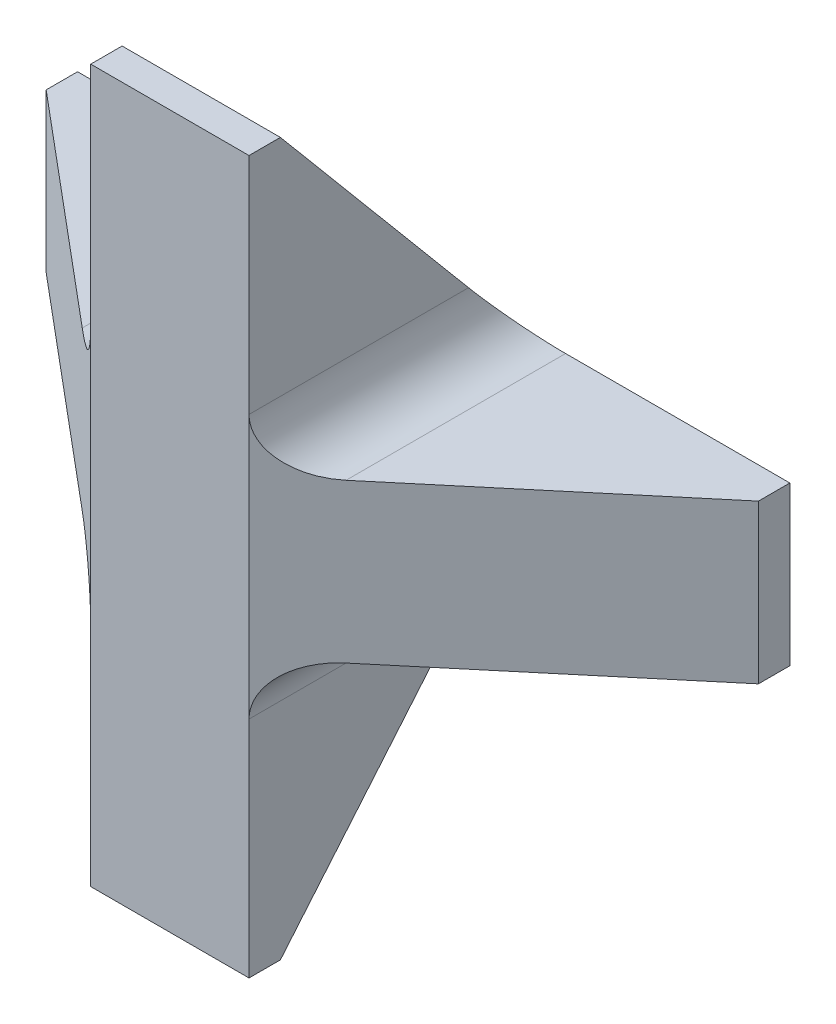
ISO-10303-21;
HEADER;
FILE_DESCRIPTION(('STEP AP214'),'2;1');
FILE_NAME('part.step','',(''),(''),'','','');
FILE_SCHEMA(('AUTOMOTIVE_DESIGN { 1 0 10303 214 1 1 1 1 }'));
ENDSEC;
DATA;
#1=APPLICATION_CONTEXT('core data for automotive mechanical design processes');
#2=APPLICATION_PROTOCOL_DEFINITION('international standard','automotive_design',2000,#1);
#3=PRODUCT_CONTEXT('',#1,'mechanical');
#4=PRODUCT('Part','Part','',(#3));
#5=PRODUCT_RELATED_PRODUCT_CATEGORY('part','',(#4));
#6=PRODUCT_DEFINITION_FORMATION('','',#4);
#7=PRODUCT_DEFINITION_CONTEXT('part definition',#1,'design');
#8=PRODUCT_DEFINITION('design','',#6,#7);
#9=PRODUCT_DEFINITION_SHAPE('','',#8);
#10=(LENGTH_UNIT() NAMED_UNIT(*) SI_UNIT(.MILLI.,.METRE.));
#11=(NAMED_UNIT(*) PLANE_ANGLE_UNIT() SI_UNIT($,.RADIAN.));
#12=(NAMED_UNIT(*) SI_UNIT($,.STERADIAN.) SOLID_ANGLE_UNIT());
#13=UNCERTAINTY_MEASURE_WITH_UNIT(LENGTH_MEASURE(1.E-05),#10,'distance_accuracy_value','');
#14=(GEOMETRIC_REPRESENTATION_CONTEXT(3) GLOBAL_UNCERTAINTY_ASSIGNED_CONTEXT((#13)) GLOBAL_UNIT_ASSIGNED_CONTEXT((#10,
#11,#12)) REPRESENTATION_CONTEXT('',''));
#15=CARTESIAN_POINT('',(0.,0.,0.));
#16=DIRECTION('',(0.,0.,1.));
#17=DIRECTION('',(1.,0.,0.));
#18=AXIS2_PLACEMENT_3D('',#15,#16,#17);
#19=CARTESIAN_POINT('',(0.,3.,0.));
#20=DIRECTION('',(0.,-1.,0.));
#21=DIRECTION('',(0.,0.,-1.));
#22=AXIS2_PLACEMENT_3D('',#19,#20,#21);
#23=PLANE('',#22);
#24=DIRECTION('',(-1.,0.,0.));
#25=VECTOR('',#24,1.);
#26=CARTESIAN_POINT('',(0.,3.,0.));
#27=LINE('',#26,#25);
#28=CARTESIAN_POINT('',(13.5,3.,0.));
#29=VERTEX_POINT('',#28);
#30=CARTESIAN_POINT('',(9.25,3.,0.));
#31=VERTEX_POINT('',#30);
#32=EDGE_CURVE('E196',#29,#31,#27,.T.);
#33=ORIENTED_EDGE('',*,*,#32,.T.);
#34=DIRECTION('',(0.,0.,1.));
#35=VECTOR('',#34,1.);
#36=CARTESIAN_POINT('',(9.25,3.,0.));
#37=LINE('',#36,#35);
#38=CARTESIAN_POINT('',(9.25,3.,4.1609003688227));
#39=VERTEX_POINT('',#38);
#40=EDGE_CURVE('E264',#31,#39,#37,.T.);
#41=ORIENTED_EDGE('',*,*,#40,.T.);
#42=DIRECTION('',(-0.766044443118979,0.,0.642787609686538));
#43=VECTOR('',#42,1.);
#44=CARTESIAN_POINT('',(13.5,3.,0.594726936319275));
#45=LINE('',#44,#43);
#46=CARTESIAN_POINT('',(13.5,3.,0.594726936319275));
#47=VERTEX_POINT('',#46);
#48=EDGE_CURVE('E246',#39,#47,#45,.F.);
#49=ORIENTED_EDGE('',*,*,#48,.T.);
#50=DIRECTION('',(0.,0.,-1.));
#51=VECTOR('',#50,1.);
#52=CARTESIAN_POINT('',(13.5,3.,0.));
#53=LINE('',#52,#51);
#54=EDGE_CURVE('E194',#47,#29,#53,.T.);
#55=ORIENTED_EDGE('',*,*,#54,.T.);
#56=EDGE_LOOP('',(#33,#41,#49,#55));
#57=FACE_BOUND('',#56,.T.);
#58=ADVANCED_FACE('F39',(#57),#23,.F.);
#59=CARTESIAN_POINT('',(0.,0.,0.));
#60=DIRECTION('',(0.,-1.,0.));
#61=DIRECTION('',(0.,0.,-1.));
#62=AXIS2_PLACEMENT_3D('',#59,#60,#61);
#63=PLANE('',#62);
#64=DIRECTION('',(0.766044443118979,0.,-0.642787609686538));
#65=VECTOR('',#64,1.);
#66=CARTESIAN_POINT('',(5.87072064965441,0.,6.99645242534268));
#67=LINE('',#66,#65);
#68=CARTESIAN_POINT('',(13.5,0.,0.594726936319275));
#69=VERTEX_POINT('',#68);
#70=CARTESIAN_POINT('',(9.25,0.,4.1609003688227));
#71=VERTEX_POINT('',#70);
#72=EDGE_CURVE('E243',#69,#71,#67,.F.);
#73=ORIENTED_EDGE('',*,*,#72,.T.);
#74=DIRECTION('',(0.,0.,1.));
#75=VECTOR('',#74,1.);
#76=CARTESIAN_POINT('',(9.25,0.,0.));
#77=LINE('',#76,#75);
#78=CARTESIAN_POINT('',(9.25,0.,0.));
#79=VERTEX_POINT('',#78);
#80=EDGE_CURVE('E252',#71,#79,#77,.F.);
#81=ORIENTED_EDGE('',*,*,#80,.T.);
#82=DIRECTION('',(-1.,0.,0.));
#83=VECTOR('',#82,1.);
#84=CARTESIAN_POINT('',(0.,0.,0.));
#85=LINE('',#84,#83);
#86=CARTESIAN_POINT('',(13.5,0.,0.));
#87=VERTEX_POINT('',#86);
#88=EDGE_CURVE('E197',#87,#79,#85,.T.);
#89=ORIENTED_EDGE('',*,*,#88,.F.);
#90=DIRECTION('',(0.,0.,-1.));
#91=VECTOR('',#90,1.);
#92=CARTESIAN_POINT('',(13.5,0.,0.));
#93=LINE('',#92,#91);
#94=EDGE_CURVE('E203',#69,#87,#93,.T.);
#95=ORIENTED_EDGE('',*,*,#94,.F.);
#96=EDGE_LOOP('',(#73,#81,#89,#95));
#97=FACE_BOUND('',#96,.T.);
#98=ADVANCED_FACE('F338',(#97),#63,.T.);
#99=CARTESIAN_POINT('',(0.,3.,5.));
#100=DIRECTION('',(1.,0.,0.));
#101=DIRECTION('',(0.,0.,-1.));
#102=AXIS2_PLACEMENT_3D('',#99,#100,#101);
#103=PLANE('',#102);
#104=DIRECTION('',(0.,0.,1.));
#105=VECTOR('',#104,1.);
#106=CARTESIAN_POINT('',(0.,0.,5.));
#107=LINE('',#106,#105);
#108=CARTESIAN_POINT('',(0.,0.,0.));
#109=VERTEX_POINT('',#108);
#110=CARTESIAN_POINT('',(0.,0.,0.594726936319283));
#111=VERTEX_POINT('',#110);
#112=EDGE_CURVE('E190',#109,#111,#107,.T.);
#113=ORIENTED_EDGE('',*,*,#112,.T.);
#114=DIRECTION('',(0.,1.,0.));
#115=VECTOR('',#114,1.);
#116=CARTESIAN_POINT('',(0.,3.,0.594726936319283));
#117=LINE('',#116,#115);
#118=CARTESIAN_POINT('',(0.,3.,0.594726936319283));
#119=VERTEX_POINT('',#118);
#120=EDGE_CURVE('E232',#111,#119,#117,.T.);
#121=ORIENTED_EDGE('',*,*,#120,.T.);
#122=DIRECTION('',(0.,0.,1.));
#123=VECTOR('',#122,1.);
#124=CARTESIAN_POINT('',(0.,3.,5.));
#125=LINE('',#124,#123);
#126=CARTESIAN_POINT('',(0.,3.,0.));
#127=VERTEX_POINT('',#126);
#128=EDGE_CURVE('E195',#127,#119,#125,.T.);
#129=ORIENTED_EDGE('',*,*,#128,.F.);
#130=DIRECTION('',(0.,-1.,0.));
#131=VECTOR('',#130,1.);
#132=CARTESIAN_POINT('',(0.,3.,0.));
#133=LINE('',#132,#131);
#134=EDGE_CURVE('E201',#127,#109,#133,.T.);
#135=ORIENTED_EDGE('',*,*,#134,.T.);
#136=EDGE_LOOP('',(#113,#121,#129,#135));
#137=FACE_BOUND('',#136,.T.);
#138=ADVANCED_FACE('F307',(#137),#103,.F.);
#139=CARTESIAN_POINT('',(13.5,3.,5.));
#140=DIRECTION('',(0.,0.,-1.));
#141=DIRECTION('',(-1.,0.,0.));
#142=AXIS2_PLACEMENT_3D('',#139,#140,#141);
#143=PLANE('',#142);
#144=DIRECTION('',(0.,-1.,0.));
#145=VECTOR('',#144,1.);
#146=CARTESIAN_POINT('',(5.25,8.25,5.));
#147=LINE('',#146,#145);
#148=CARTESIAN_POINT('',(5.25,8.25,5.));
#149=VERTEX_POINT('',#148);
#150=CARTESIAN_POINT('',(5.25000000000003,4.,5.));
#151=VERTEX_POINT('',#150);
#152=EDGE_CURVE('E169',#149,#151,#147,.T.);
#153=ORIENTED_EDGE('',*,*,#152,.T.);
#154=DIRECTION('',(0.,-1.,0.));
#155=VECTOR('',#154,1.);
#156=CARTESIAN_POINT('',(5.25000000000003,3.,5.));
#157=LINE('',#156,#155);
#158=CARTESIAN_POINT('',(5.25,-0.999999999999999,5.));
#159=VERTEX_POINT('',#158);
#160=EDGE_CURVE('E233',#151,#159,#157,.T.);
#161=ORIENTED_EDGE('',*,*,#160,.T.);
#162=CARTESIAN_POINT('',(5.25,-5.25,5.));
#163=VERTEX_POINT('',#162);
#164=EDGE_CURVE('E174',#159,#163,#147,.T.);
#165=ORIENTED_EDGE('',*,*,#164,.T.);
#166=DIRECTION('',(1.,0.,0.));
#167=VECTOR('',#166,1.);
#168=CARTESIAN_POINT('',(5.25,-5.25,5.));
#169=LINE('',#168,#167);
#170=CARTESIAN_POINT('',(8.25,-5.25,5.));
#171=VERTEX_POINT('',#170);
#172=EDGE_CURVE('E172',#163,#171,#169,.T.);
#173=ORIENTED_EDGE('',*,*,#172,.T.);
#174=DIRECTION('',(0.,1.,0.));
#175=VECTOR('',#174,1.);
#176=CARTESIAN_POINT('',(8.25,-5.25,5.));
#177=LINE('',#176,#175);
#178=CARTESIAN_POINT('',(8.24999999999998,-1.,5.));
#179=VERTEX_POINT('',#178);
#180=EDGE_CURVE('E164',#171,#179,#177,.T.);
#181=ORIENTED_EDGE('',*,*,#180,.T.);
#182=DIRECTION('',(0.,1.,0.));
#183=VECTOR('',#182,1.);
#184=CARTESIAN_POINT('',(8.24999999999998,3.,5.));
#185=LINE('',#184,#183);
#186=CARTESIAN_POINT('',(8.25,4.,5.));
#187=VERTEX_POINT('',#186);
#188=EDGE_CURVE('E65',#179,#187,#185,.T.);
#189=ORIENTED_EDGE('',*,*,#188,.T.);
#190=CARTESIAN_POINT('',(8.25,8.25,5.));
#191=VERTEX_POINT('',#190);
#192=EDGE_CURVE('E178',#187,#191,#177,.T.);
#193=ORIENTED_EDGE('',*,*,#192,.T.);
#194=DIRECTION('',(-1.,0.,0.));
#195=VECTOR('',#194,1.);
#196=CARTESIAN_POINT('',(8.25,8.25,5.));
#197=LINE('',#196,#195);
#198=EDGE_CURVE('E160',#191,#149,#197,.T.);
#199=ORIENTED_EDGE('',*,*,#198,.T.);
#200=EDGE_LOOP('',(#153,#161,#165,#173,#181,#189,#193,#199));
#201=FACE_BOUND('',#200,.T.);
#202=ADVANCED_FACE('F180',(#201),#143,.F.);
#203=CARTESIAN_POINT('',(13.5,3.,0.));
#204=DIRECTION('',(-1.,0.,0.));
#205=DIRECTION('',(0.,0.,1.));
#206=AXIS2_PLACEMENT_3D('',#203,#204,#205);
#207=PLANE('',#206);
#208=ORIENTED_EDGE('',*,*,#54,.F.);
#209=DIRECTION('',(0.,-1.,0.));
#210=VECTOR('',#209,1.);
#211=CARTESIAN_POINT('',(13.5,3.,0.594726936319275));
#212=LINE('',#211,#210);
#213=EDGE_CURVE('E239',#47,#69,#212,.T.);
#214=ORIENTED_EDGE('',*,*,#213,.T.);
#215=ORIENTED_EDGE('',*,*,#94,.T.);
#216=DIRECTION('',(0.,-1.,0.));
#217=VECTOR('',#216,1.);
#218=CARTESIAN_POINT('',(13.5,3.,0.));
#219=LINE('',#218,#217);
#220=EDGE_CURVE('E211',#29,#87,#219,.T.);
#221=ORIENTED_EDGE('',*,*,#220,.F.);
#222=EDGE_LOOP('',(#208,#214,#215,#221));
#223=FACE_BOUND('',#222,.T.);
#224=ADVANCED_FACE('F344',(#223),#207,.F.);
#225=CARTESIAN_POINT('',(0.,3.,0.));
#226=DIRECTION('',(0.,0.,1.));
#227=DIRECTION('',(1.,0.,0.));
#228=AXIS2_PLACEMENT_3D('',#225,#226,#227);
#229=PLANE('',#228);
#230=ORIENTED_EDGE('',*,*,#88,.T.);
#231=DIRECTION('',(-1.,0.,0.));
#232=VECTOR('',#231,1.);
#233=CARTESIAN_POINT('',(5.25,0.,0.));
#234=LINE('',#233,#232);
#235=CARTESIAN_POINT('',(4.25,0.,0.));
#236=VERTEX_POINT('',#235);
#237=EDGE_CURVE('E223',#79,#236,#234,.T.);
#238=ORIENTED_EDGE('',*,*,#237,.T.);
#239=EDGE_CURVE('E207',#236,#109,#85,.T.);
#240=ORIENTED_EDGE('',*,*,#239,.T.);
#241=ORIENTED_EDGE('',*,*,#134,.F.);
#242=CARTESIAN_POINT('',(4.25,3.,0.));
#243=VERTEX_POINT('',#242);
#244=EDGE_CURVE('E199',#243,#127,#27,.T.);
#245=ORIENTED_EDGE('',*,*,#244,.F.);
#246=DIRECTION('',(1.,0.,0.));
#247=VECTOR('',#246,1.);
#248=CARTESIAN_POINT('',(8.25,3.,0.));
#249=LINE('',#248,#247);
#250=EDGE_CURVE('E53',#243,#31,#249,.T.);
#251=ORIENTED_EDGE('',*,*,#250,.T.);
#252=ORIENTED_EDGE('',*,*,#32,.F.);
#253=ORIENTED_EDGE('',*,*,#220,.T.);
#254=EDGE_LOOP('',(#230,#238,#240,#241,#245,#251,#252,#253));
#255=FACE_BOUND('',#254,.T.);
#256=ADVANCED_FACE('F347',(#255),#229,.F.);
#257=DIRECTION('',(-0.76604444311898,0.,-0.642787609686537));
#258=VECTOR('',#257,1.);
#259=CARTESIAN_POINT('',(5.25000000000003,3.,5.));
#260=LINE('',#259,#258);
#261=CARTESIAN_POINT('',(4.25,3.,4.16090036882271));
#262=VERTEX_POINT('',#261);
#263=EDGE_CURVE('E240',#119,#262,#260,.F.);
#264=ORIENTED_EDGE('',*,*,#263,.T.);
#265=DIRECTION('',(0.,0.,-1.));
#266=VECTOR('',#265,1.);
#267=CARTESIAN_POINT('',(4.25,3.,0.));
#268=LINE('',#267,#266);
#269=EDGE_CURVE('E258',#262,#243,#268,.T.);
#270=ORIENTED_EDGE('',*,*,#269,.T.);
#271=ORIENTED_EDGE('',*,*,#244,.T.);
#272=ORIENTED_EDGE('',*,*,#128,.T.);
#273=EDGE_LOOP('',(#264,#270,#271,#272));
#274=FACE_BOUND('',#273,.T.);
#275=ADVANCED_FACE('F304',(#274),#23,.F.);
#276=ORIENTED_EDGE('',*,*,#239,.F.);
#277=DIRECTION('',(0.,0.,-1.));
#278=VECTOR('',#277,1.);
#279=CARTESIAN_POINT('',(4.25,0.,5.));
#280=LINE('',#279,#278);
#281=CARTESIAN_POINT('',(4.25,0.,4.16090036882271));
#282=VERTEX_POINT('',#281);
#283=EDGE_CURVE('E260',#236,#282,#280,.F.);
#284=ORIENTED_EDGE('',*,*,#283,.T.);
#285=DIRECTION('',(0.76604444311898,0.,0.642787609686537));
#286=VECTOR('',#285,1.);
#287=CARTESIAN_POINT('',(-0.292845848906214,0.,0.349000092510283));
#288=LINE('',#287,#286);
#289=EDGE_CURVE('E231',#282,#111,#288,.F.);
#290=ORIENTED_EDGE('',*,*,#289,.T.);
#291=ORIENTED_EDGE('',*,*,#112,.F.);
#292=EDGE_LOOP('',(#276,#284,#290,#291));
#293=FACE_BOUND('',#292,.T.);
#294=ADVANCED_FACE('F351',(#293),#63,.T.);
#295=CARTESIAN_POINT('',(5.25,-5.25,0.));
#296=DIRECTION('',(0.,-1.,0.));
#297=DIRECTION('',(1.,0.,0.));
#298=AXIS2_PLACEMENT_3D('',#295,#296,#297);
#299=PLANE('',#298);
#300=DIRECTION('',(0.,0.,1.));
#301=VECTOR('',#300,1.);
#302=CARTESIAN_POINT('',(5.25,-5.25,0.));
#303=LINE('',#302,#301);
#304=CARTESIAN_POINT('',(5.25,-5.25,4.40527306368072));
#305=VERTEX_POINT('',#304);
#306=EDGE_CURVE('E165',#305,#163,#303,.T.);
#307=ORIENTED_EDGE('',*,*,#306,.F.);
#308=DIRECTION('',(1.,0.,0.));
#309=VECTOR('',#308,1.);
#310=CARTESIAN_POINT('',(8.25,-5.25,4.40527306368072));
#311=LINE('',#310,#309);
#312=CARTESIAN_POINT('',(8.25,-5.25,4.40527306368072));
#313=VERTEX_POINT('',#312);
#314=EDGE_CURVE('E213',#305,#313,#311,.T.);
#315=ORIENTED_EDGE('',*,*,#314,.T.);
#316=DIRECTION('',(0.,0.,1.));
#317=VECTOR('',#316,1.);
#318=CARTESIAN_POINT('',(8.25,-5.25,0.));
#319=LINE('',#318,#317);
#320=EDGE_CURVE('E189',#313,#171,#319,.T.);
#321=ORIENTED_EDGE('',*,*,#320,.T.);
#322=ORIENTED_EDGE('',*,*,#172,.F.);
#323=EDGE_LOOP('',(#307,#315,#321,#322));
#324=FACE_BOUND('',#323,.T.);
#325=ADVANCED_FACE('F329',(#324),#299,.T.);
#326=CARTESIAN_POINT('',(5.25,8.25,0.));
#327=DIRECTION('',(-1.,0.,0.));
#328=DIRECTION('',(0.,0.,1.));
#329=AXIS2_PLACEMENT_3D('',#326,#327,#328);
#330=PLANE('',#329);
#331=ORIENTED_EDGE('',*,*,#164,.F.);
#332=DIRECTION('',(0.,0.,-1.));
#333=VECTOR('',#332,1.);
#334=CARTESIAN_POINT('',(5.25,-0.999999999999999,0.));
#335=LINE('',#334,#333);
#336=CARTESIAN_POINT('',(5.25,-1.,0.839099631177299));
#337=VERTEX_POINT('',#336);
#338=EDGE_CURVE('E251',#159,#337,#335,.T.);
#339=ORIENTED_EDGE('',*,*,#338,.T.);
#340=DIRECTION('',(0.,-0.76604444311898,0.642787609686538));
#341=VECTOR('',#340,1.);
#342=CARTESIAN_POINT('',(5.25,4.84129873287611,-4.06233198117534));
#343=LINE('',#342,#341);
#344=EDGE_CURVE('E222',#337,#305,#343,.T.);
#345=ORIENTED_EDGE('',*,*,#344,.T.);
#346=ORIENTED_EDGE('',*,*,#306,.T.);
#347=EDGE_LOOP('',(#331,#339,#345,#346));
#348=FACE_BOUND('',#347,.T.);
#349=ADVANCED_FACE('F321',(#348),#330,.T.);
#350=CARTESIAN_POINT('',(8.25,-5.25,0.));
#351=DIRECTION('',(1.,0.,0.));
#352=DIRECTION('',(0.,0.,-1.));
#353=AXIS2_PLACEMENT_3D('',#350,#351,#352);
#354=PLANE('',#353);
#355=DIRECTION('',(0.,0.76604444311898,-0.642787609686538));
#356=VECTOR('',#355,1.);
#357=CARTESIAN_POINT('',(8.25,-3.08082646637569,2.58512035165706));
#358=LINE('',#357,#356);
#359=CARTESIAN_POINT('',(8.25,-0.999999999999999,0.839099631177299));
#360=VERTEX_POINT('',#359);
#361=EDGE_CURVE('E220',#313,#360,#358,.T.);
#362=ORIENTED_EDGE('',*,*,#361,.T.);
#363=DIRECTION('',(0.,0.,1.));
#364=VECTOR('',#363,1.);
#365=CARTESIAN_POINT('',(8.25,-1.,5.));
#366=LINE('',#365,#364);
#367=EDGE_CURVE('E247',#360,#179,#366,.T.);
#368=ORIENTED_EDGE('',*,*,#367,.T.);
#369=ORIENTED_EDGE('',*,*,#180,.F.);
#370=ORIENTED_EDGE('',*,*,#320,.F.);
#371=EDGE_LOOP('',(#362,#368,#369,#370));
#372=FACE_BOUND('',#371,.T.);
#373=ADVANCED_FACE('F332',(#372),#354,.T.);
#374=ORIENTED_EDGE('',*,*,#192,.F.);
#375=DIRECTION('',(0.,0.,1.));
#376=VECTOR('',#375,1.);
#377=CARTESIAN_POINT('',(8.25,4.,0.));
#378=LINE('',#377,#376);
#379=CARTESIAN_POINT('',(8.25,4.,0.839099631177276));
#380=VERTEX_POINT('',#379);
#381=EDGE_CURVE('E266',#187,#380,#378,.F.);
#382=ORIENTED_EDGE('',*,*,#381,.T.);
#383=DIRECTION('',(0.,0.766044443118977,0.64278760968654));
#384=VECTOR('',#383,1.);
#385=CARTESIAN_POINT('',(8.25,-1.84129873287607,-4.06233198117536));
#386=LINE('',#385,#384);
#387=CARTESIAN_POINT('',(8.25,8.25,4.40527306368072));
#388=VERTEX_POINT('',#387);
#389=EDGE_CURVE('E226',#380,#388,#386,.T.);
#390=ORIENTED_EDGE('',*,*,#389,.T.);
#391=DIRECTION('',(0.,0.,1.));
#392=VECTOR('',#391,1.);
#393=CARTESIAN_POINT('',(8.25,8.25,0.));
#394=LINE('',#393,#392);
#395=EDGE_CURVE('E184',#388,#191,#394,.T.);
#396=ORIENTED_EDGE('',*,*,#395,.T.);
#397=EDGE_LOOP('',(#374,#382,#390,#396));
#398=FACE_BOUND('',#397,.T.);
#399=ADVANCED_FACE('F291',(#398),#354,.T.);
#400=DIRECTION('',(0.,-0.766044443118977,-0.64278760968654));
#401=VECTOR('',#400,1.);
#402=CARTESIAN_POINT('',(5.25,6.08082646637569,2.58512035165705));
#403=LINE('',#402,#401);
#404=CARTESIAN_POINT('',(5.25,8.25,4.40527306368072));
#405=VERTEX_POINT('',#404);
#406=CARTESIAN_POINT('',(5.25,4.,0.83909963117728));
#407=VERTEX_POINT('',#406);
#408=EDGE_CURVE('E228',#405,#407,#403,.T.);
#409=ORIENTED_EDGE('',*,*,#408,.T.);
#410=DIRECTION('',(0.,0.,-1.));
#411=VECTOR('',#410,1.);
#412=CARTESIAN_POINT('',(5.25,4.,0.));
#413=LINE('',#412,#411);
#414=EDGE_CURVE('E175',#407,#151,#413,.F.);
#415=ORIENTED_EDGE('',*,*,#414,.T.);
#416=ORIENTED_EDGE('',*,*,#152,.F.);
#417=DIRECTION('',(0.,0.,1.));
#418=VECTOR('',#417,1.);
#419=CARTESIAN_POINT('',(5.25,8.25,0.));
#420=LINE('',#419,#418);
#421=EDGE_CURVE('E151',#405,#149,#420,.T.);
#422=ORIENTED_EDGE('',*,*,#421,.F.);
#423=EDGE_LOOP('',(#409,#415,#416,#422));
#424=FACE_BOUND('',#423,.T.);
#425=ADVANCED_FACE('F167',(#424),#330,.T.);
#426=CARTESIAN_POINT('',(8.25,8.25,0.));
#427=DIRECTION('',(0.,1.,0.));
#428=DIRECTION('',(-1.,0.,0.));
#429=AXIS2_PLACEMENT_3D('',#426,#427,#428);
#430=PLANE('',#429);
#431=ORIENTED_EDGE('',*,*,#395,.F.);
#432=DIRECTION('',(-1.,0.,0.));
#433=VECTOR('',#432,1.);
#434=CARTESIAN_POINT('',(5.25,8.25,4.40527306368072));
#435=LINE('',#434,#433);
#436=EDGE_CURVE('E163',#388,#405,#435,.T.);
#437=ORIENTED_EDGE('',*,*,#436,.T.);
#438=ORIENTED_EDGE('',*,*,#421,.T.);
#439=ORIENTED_EDGE('',*,*,#198,.F.);
#440=EDGE_LOOP('',(#431,#437,#438,#439));
#441=FACE_BOUND('',#440,.T.);
#442=ADVANCED_FACE('F159',(#441),#430,.T.);
#443=CARTESIAN_POINT('',(5.25,-5.25,4.40527306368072));
#444=DIRECTION('',(0.,-0.642787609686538,-0.766044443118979));
#445=DIRECTION('',(-1.,0.,0.));
#446=AXIS2_PLACEMENT_3D('',#443,#444,#445);
#447=PLANE('',#446);
#448=ORIENTED_EDGE('',*,*,#344,.F.);
#449=CARTESIAN_POINT('',(4.25,-0.999999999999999,0.839099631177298));
#450=DIRECTION('',(0.,-0.642787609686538,-0.766044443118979));
#451=DIRECTION('',(0.,-0.76604444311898,0.642787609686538));
#452=AXIS2_PLACEMENT_3D('',#449,#450,#451);
#453=ELLIPSE('',#452,1.30540728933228,1.);
#454=EDGE_CURVE('E275',#337,#236,#453,.F.);
#455=ORIENTED_EDGE('',*,*,#454,.T.);
#456=ORIENTED_EDGE('',*,*,#237,.F.);
#457=CARTESIAN_POINT('',(9.25,-1.,0.839099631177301));
#458=DIRECTION('',(0.,-0.642787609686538,-0.766044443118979));
#459=DIRECTION('',(0.,0.76604444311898,-0.642787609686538));
#460=AXIS2_PLACEMENT_3D('',#457,#458,#459);
#461=ELLIPSE('',#460,1.30540728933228,1.);
#462=EDGE_CURVE('E270',#79,#360,#461,.F.);
#463=ORIENTED_EDGE('',*,*,#462,.T.);
#464=ORIENTED_EDGE('',*,*,#361,.F.);
#465=ORIENTED_EDGE('',*,*,#314,.F.);
#466=EDGE_LOOP('',(#448,#455,#456,#463,#464,#465));
#467=FACE_BOUND('',#466,.T.);
#468=ADVANCED_FACE('F324',(#467),#447,.T.);
#469=CARTESIAN_POINT('',(8.25,8.25,4.40527306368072));
#470=DIRECTION('',(0.,0.64278760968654,-0.766044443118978));
#471=DIRECTION('',(1.,0.,0.));
#472=AXIS2_PLACEMENT_3D('',#469,#470,#471);
#473=PLANE('',#472);
#474=ORIENTED_EDGE('',*,*,#389,.F.);
#475=CARTESIAN_POINT('',(9.25,4.,0.839099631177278));
#476=DIRECTION('',(0.,0.64278760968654,-0.766044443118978));
#477=DIRECTION('',(0.,0.766044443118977,0.64278760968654));
#478=AXIS2_PLACEMENT_3D('',#475,#476,#477);
#479=ELLIPSE('',#478,1.30540728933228,1.);
#480=EDGE_CURVE('E11',#380,#31,#479,.F.);
#481=ORIENTED_EDGE('',*,*,#480,.T.);
#482=ORIENTED_EDGE('',*,*,#250,.F.);
#483=CARTESIAN_POINT('',(4.25,4.,0.83909963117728));
#484=DIRECTION('',(0.,0.64278760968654,-0.766044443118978));
#485=DIRECTION('',(0.,-0.766044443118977,-0.64278760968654));
#486=AXIS2_PLACEMENT_3D('',#483,#484,#485);
#487=ELLIPSE('',#486,1.30540728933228,1.);
#488=EDGE_CURVE('E277',#243,#407,#487,.F.);
#489=ORIENTED_EDGE('',*,*,#488,.T.);
#490=ORIENTED_EDGE('',*,*,#408,.F.);
#491=ORIENTED_EDGE('',*,*,#436,.F.);
#492=EDGE_LOOP('',(#474,#481,#482,#489,#490,#491));
#493=FACE_BOUND('',#492,.T.);
#494=ADVANCED_FACE('F294',(#493),#473,.T.);
#495=CARTESIAN_POINT('',(5.25000000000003,3.,5.));
#496=DIRECTION('',(0.642787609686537,0.,-0.76604444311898));
#497=DIRECTION('',(0.,-1.,0.));
#498=AXIS2_PLACEMENT_3D('',#495,#496,#497);
#499=PLANE('',#498);
#500=ORIENTED_EDGE('',*,*,#263,.F.);
#501=ORIENTED_EDGE('',*,*,#120,.F.);
#502=ORIENTED_EDGE('',*,*,#289,.F.);
#503=CARTESIAN_POINT('',(4.25,-0.999999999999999,4.1609003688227));
#504=DIRECTION('',(0.642787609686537,0.,-0.76604444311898));
#505=DIRECTION('',(0.76604444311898,0.,0.642787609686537));
#506=AXIS2_PLACEMENT_3D('',#503,#504,#505);
#507=ELLIPSE('',#506,1.30540728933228,1.);
#508=EDGE_CURVE('E273',#282,#159,#507,.T.);
#509=ORIENTED_EDGE('',*,*,#508,.T.);
#510=ORIENTED_EDGE('',*,*,#160,.F.);
#511=CARTESIAN_POINT('',(4.25,4.,4.1609003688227));
#512=DIRECTION('',(0.642787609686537,0.,-0.76604444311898));
#513=DIRECTION('',(-0.76604444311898,0.,-0.642787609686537));
#514=AXIS2_PLACEMENT_3D('',#511,#512,#513);
#515=ELLIPSE('',#514,1.30540728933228,1.);
#516=EDGE_CURVE('E279',#151,#262,#515,.T.);
#517=ORIENTED_EDGE('',*,*,#516,.T.);
#518=EDGE_LOOP('',(#500,#501,#502,#509,#510,#517));
#519=FACE_BOUND('',#518,.T.);
#520=ADVANCED_FACE('F305',(#519),#499,.F.);
#521=CARTESIAN_POINT('',(13.5,3.,0.594726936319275));
#522=DIRECTION('',(-0.642787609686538,0.,-0.766044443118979));
#523=DIRECTION('',(0.,-1.,0.));
#524=AXIS2_PLACEMENT_3D('',#521,#522,#523);
#525=PLANE('',#524);
#526=ORIENTED_EDGE('',*,*,#48,.F.);
#527=CARTESIAN_POINT('',(9.25,4.,4.1609003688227));
#528=DIRECTION('',(-0.642787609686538,0.,-0.766044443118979));
#529=DIRECTION('',(-0.766044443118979,0.,0.642787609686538));
#530=AXIS2_PLACEMENT_3D('',#527,#528,#529);
#531=ELLIPSE('',#530,1.30540728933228,1.);
#532=EDGE_CURVE('E50',#39,#187,#531,.T.);
#533=ORIENTED_EDGE('',*,*,#532,.T.);
#534=ORIENTED_EDGE('',*,*,#188,.F.);
#535=CARTESIAN_POINT('',(9.25,-1.,4.1609003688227));
#536=DIRECTION('',(-0.642787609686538,0.,-0.766044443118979));
#537=DIRECTION('',(0.766044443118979,0.,-0.642787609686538));
#538=AXIS2_PLACEMENT_3D('',#535,#536,#537);
#539=ELLIPSE('',#538,1.30540728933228,1.);
#540=EDGE_CURVE('E269',#179,#71,#539,.T.);
#541=ORIENTED_EDGE('',*,*,#540,.T.);
#542=ORIENTED_EDGE('',*,*,#72,.F.);
#543=ORIENTED_EDGE('',*,*,#213,.F.);
#544=EDGE_LOOP('',(#526,#533,#534,#541,#542,#543));
#545=FACE_BOUND('',#544,.T.);
#546=ADVANCED_FACE('F283',(#545),#525,.F.);
#547=CARTESIAN_POINT('',(9.25,-1.,0.));
#548=DIRECTION('',(0.,0.,-1.));
#549=DIRECTION('',(-1.,0.,0.));
#550=AXIS2_PLACEMENT_3D('',#547,#548,#549);
#551=CYLINDRICAL_SURFACE('',#550,1.);
#552=ORIENTED_EDGE('',*,*,#462,.F.);
#553=ORIENTED_EDGE('',*,*,#80,.F.);
#554=ORIENTED_EDGE('',*,*,#540,.F.);
#555=ORIENTED_EDGE('',*,*,#367,.F.);
#556=EDGE_LOOP('',(#552,#553,#554,#555));
#557=FACE_BOUND('',#556,.T.);
#558=ADVANCED_FACE('F337',(#557),#551,.F.);
#559=CARTESIAN_POINT('',(4.25,-0.999999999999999,0.));
#560=DIRECTION('',(0.,0.,1.));
#561=DIRECTION('',(1.,0.,0.));
#562=AXIS2_PLACEMENT_3D('',#559,#560,#561);
#563=CYLINDRICAL_SURFACE('',#562,1.);
#564=ORIENTED_EDGE('',*,*,#508,.F.);
#565=ORIENTED_EDGE('',*,*,#283,.F.);
#566=ORIENTED_EDGE('',*,*,#454,.F.);
#567=ORIENTED_EDGE('',*,*,#338,.F.);
#568=EDGE_LOOP('',(#564,#565,#566,#567));
#569=FACE_BOUND('',#568,.T.);
#570=ADVANCED_FACE('F320',(#569),#563,.F.);
#571=CARTESIAN_POINT('',(4.25,4.,0.));
#572=DIRECTION('',(0.,0.,-1.));
#573=DIRECTION('',(-1.,0.,0.));
#574=AXIS2_PLACEMENT_3D('',#571,#572,#573);
#575=CYLINDRICAL_SURFACE('',#574,1.);
#576=ORIENTED_EDGE('',*,*,#516,.F.);
#577=ORIENTED_EDGE('',*,*,#414,.F.);
#578=ORIENTED_EDGE('',*,*,#488,.F.);
#579=ORIENTED_EDGE('',*,*,#269,.F.);
#580=EDGE_LOOP('',(#576,#577,#578,#579));
#581=FACE_BOUND('',#580,.T.);
#582=ADVANCED_FACE('F296',(#581),#575,.F.);
#583=CARTESIAN_POINT('',(9.25,4.,0.));
#584=DIRECTION('',(0.,0.,1.));
#585=DIRECTION('',(1.,0.,0.));
#586=AXIS2_PLACEMENT_3D('',#583,#584,#585);
#587=CYLINDRICAL_SURFACE('',#586,1.);
#588=ORIENTED_EDGE('',*,*,#480,.F.);
#589=ORIENTED_EDGE('',*,*,#381,.F.);
#590=ORIENTED_EDGE('',*,*,#532,.F.);
#591=ORIENTED_EDGE('',*,*,#40,.F.);
#592=EDGE_LOOP('',(#588,#589,#590,#591));
#593=FACE_BOUND('',#592,.T.);
#594=ADVANCED_FACE('F41',(#593),#587,.F.);
#595=CLOSED_SHELL('',(#58,#98,#138,#202,#224,#256,#275,#294,#325,#349,#373,#399,#425,#442,#468,
#494,#520,#546,#558,#570,#582,#594));
#596=MANIFOLD_SOLID_BREP('B2',#595);
#597=ADVANCED_BREP_SHAPE_REPRESENTATION('',(#18,#596),#14);
#598=SHAPE_DEFINITION_REPRESENTATION(#9,#597);
ENDSEC;
END-ISO-10303-21;
